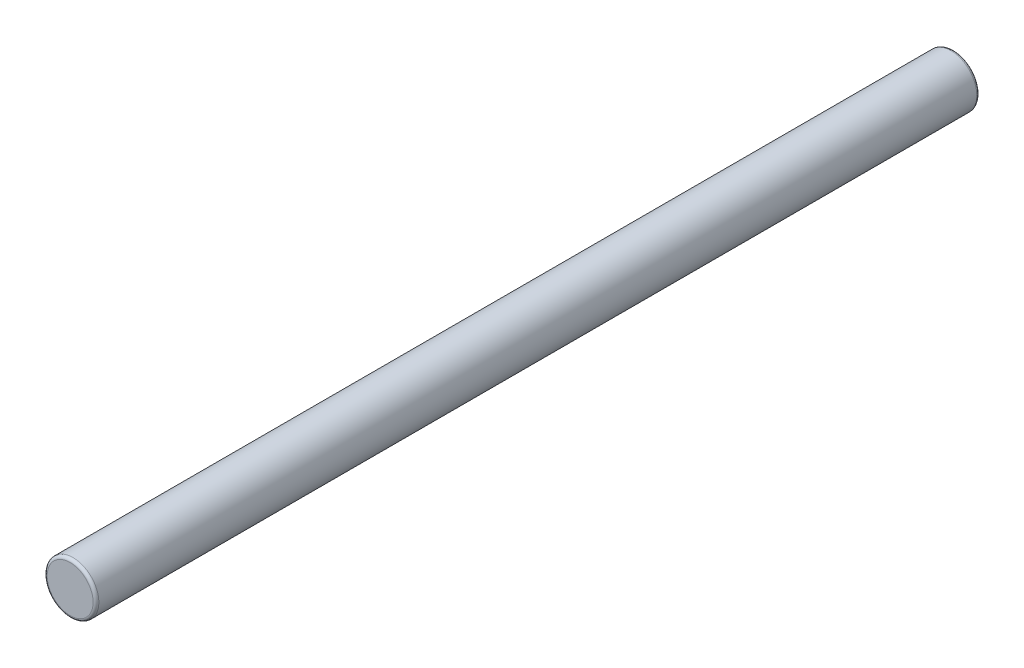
from build123d import *

# Parameters (mm, degrees)
SCHIZZO1_R  = 18
RACCORDO1_R = 2


with BuildPart() as part:
    # Sweep1: sweep along a path in Schizzo2
    with BuildLine(Plane(origin=(0, 0, 0), x_dir=(0, 0, -1), z_dir=(1, 0, 0))) as sweep1_path:
        Line((0, 0), (615, 0))
    # Schizzo1 → Sweep1 (sweep)
    with BuildSketch(Plane.XY):
        Circle(SCHIZZO1_R)
    sweep(path=sweep1_path.line)

    # Raccordo1
    raccordo1_edges = [part.edges().sort_by_distance(p)[0] for p in [
        (-18, 0, 0),
        (-18, 0, -615),
    ]]
    fillet(raccordo1_edges, radius=RACCORDO1_R)


solid = part.part
